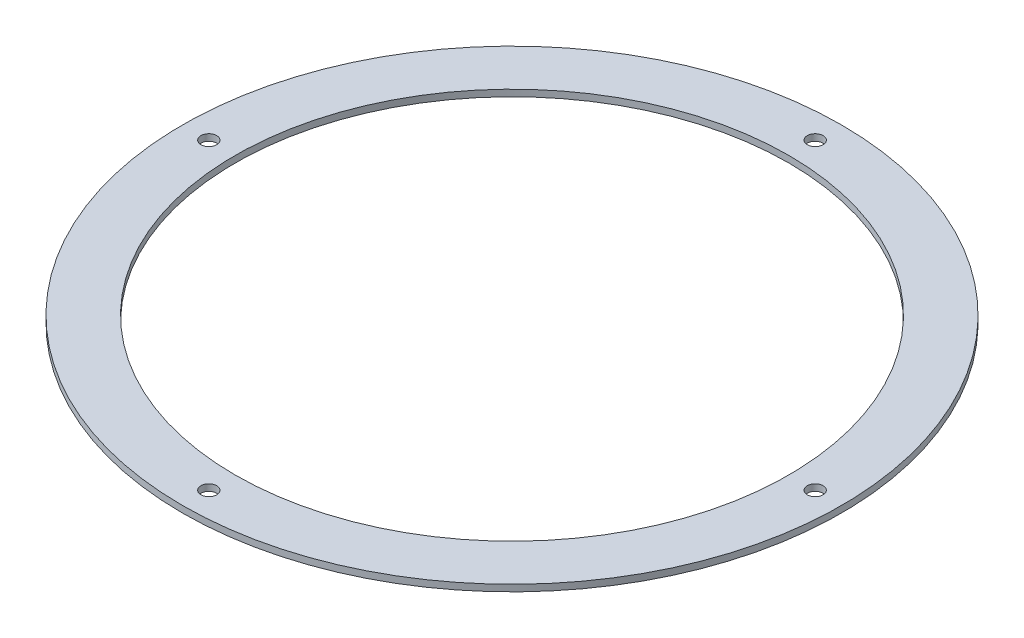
ISO-10303-21;
HEADER;
FILE_DESCRIPTION(('STEP AP214'),'2;1');
FILE_NAME('part.step','',(''),(''),'','','');
FILE_SCHEMA(('AUTOMOTIVE_DESIGN { 1 0 10303 214 1 1 1 1 }'));
ENDSEC;
DATA;
#1=APPLICATION_CONTEXT('core data for automotive mechanical design processes');
#2=APPLICATION_PROTOCOL_DEFINITION('international standard','automotive_design',2000,#1);
#3=PRODUCT_CONTEXT('',#1,'mechanical');
#4=PRODUCT('Part','Part','',(#3));
#5=PRODUCT_RELATED_PRODUCT_CATEGORY('part','',(#4));
#6=PRODUCT_DEFINITION_FORMATION('','',#4);
#7=PRODUCT_DEFINITION_CONTEXT('part definition',#1,'design');
#8=PRODUCT_DEFINITION('design','',#6,#7);
#9=PRODUCT_DEFINITION_SHAPE('','',#8);
#10=(LENGTH_UNIT() NAMED_UNIT(*) SI_UNIT(.MILLI.,.METRE.));
#11=(NAMED_UNIT(*) PLANE_ANGLE_UNIT() SI_UNIT($,.RADIAN.));
#12=(NAMED_UNIT(*) SI_UNIT($,.STERADIAN.) SOLID_ANGLE_UNIT());
#13=UNCERTAINTY_MEASURE_WITH_UNIT(LENGTH_MEASURE(1.E-05),#10,'distance_accuracy_value','');
#14=(GEOMETRIC_REPRESENTATION_CONTEXT(3) GLOBAL_UNCERTAINTY_ASSIGNED_CONTEXT((#13)) GLOBAL_UNIT_ASSIGNED_CONTEXT((#10,
#11,#12)) REPRESENTATION_CONTEXT('',''));
#15=CARTESIAN_POINT('',(0.,0.,0.));
#16=DIRECTION('',(0.,0.,1.));
#17=DIRECTION('',(1.,0.,0.));
#18=AXIS2_PLACEMENT_3D('',#15,#16,#17);
#19=CARTESIAN_POINT('',(0.,0.5,0.));
#20=DIRECTION('',(0.,1.,0.));
#21=DIRECTION('',(0.,0.,1.));
#22=AXIS2_PLACEMENT_3D('',#19,#20,#21);
#23=PLANE('',#22);
#24=CARTESIAN_POINT('',(-2.38095524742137E-13,0.5,23.));
#25=DIRECTION('',(0.,1.,0.));
#26=DIRECTION('',(1.,0.,0.));
#27=AXIS2_PLACEMENT_3D('',#24,#25,#26);
#28=CIRCLE('',#27,0.6);
#29=CARTESIAN_POINT('',(0.599999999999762,0.5,23.));
#30=VERTEX_POINT('',#29);
#31=EDGE_CURVE('E76',#30,#30,#28,.T.);
#32=ORIENTED_EDGE('',*,*,#31,.F.);
#33=EDGE_LOOP('',(#32));
#34=FACE_BOUND('',#33,.T.);
#35=CARTESIAN_POINT('',(23.,0.5,0.));
#36=DIRECTION('',(0.,1.,0.));
#37=DIRECTION('',(0.,0.,-1.));
#38=AXIS2_PLACEMENT_3D('',#35,#36,#37);
#39=CIRCLE('',#38,0.6);
#40=CARTESIAN_POINT('',(23.,0.5,-0.600000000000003));
#41=VERTEX_POINT('',#40);
#42=EDGE_CURVE('E70',#41,#41,#39,.T.);
#43=ORIENTED_EDGE('',*,*,#42,.F.);
#44=EDGE_LOOP('',(#43));
#45=FACE_BOUND('',#44,.T.);
#46=CARTESIAN_POINT('',(0.,0.5,-23.));
#47=DIRECTION('',(0.,1.,0.));
#48=DIRECTION('',(-1.,0.,0.));
#49=AXIS2_PLACEMENT_3D('',#46,#47,#48);
#50=CIRCLE('',#49,0.6);
#51=CARTESIAN_POINT('',(-0.599999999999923,0.5,-23.));
#52=VERTEX_POINT('',#51);
#53=EDGE_CURVE('E64',#52,#52,#50,.T.);
#54=ORIENTED_EDGE('',*,*,#53,.F.);
#55=EDGE_LOOP('',(#54));
#56=FACE_BOUND('',#55,.T.);
#57=CARTESIAN_POINT('',(-23.,0.5,0.));
#58=DIRECTION('',(0.,1.,0.));
#59=DIRECTION('',(0.,0.,1.));
#60=AXIS2_PLACEMENT_3D('',#57,#58,#59);
#61=CIRCLE('',#60,0.6);
#62=CARTESIAN_POINT('',(-23.,0.5,0.600000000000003));
#63=VERTEX_POINT('',#62);
#64=EDGE_CURVE('E58',#63,#63,#61,.T.);
#65=ORIENTED_EDGE('',*,*,#64,.F.);
#66=EDGE_LOOP('',(#65));
#67=FACE_BOUND('',#66,.T.);
#68=CARTESIAN_POINT('',(0.,0.5,0.));
#69=DIRECTION('',(0.,1.,0.));
#70=DIRECTION('',(0.,0.,1.));
#71=AXIS2_PLACEMENT_3D('',#68,#69,#70);
#72=CIRCLE('',#71,25.);
#73=CARTESIAN_POINT('',(0.,0.5,25.));
#74=VERTEX_POINT('',#73);
#75=EDGE_CURVE('E10',#74,#74,#72,.T.);
#76=ORIENTED_EDGE('',*,*,#75,.T.);
#77=EDGE_LOOP('',(#76));
#78=FACE_BOUND('',#77,.T.);
#79=CARTESIAN_POINT('',(0.,0.5,0.));
#80=DIRECTION('',(0.,1.,0.));
#81=DIRECTION('',(0.,0.,1.));
#82=AXIS2_PLACEMENT_3D('',#79,#80,#81);
#83=CIRCLE('',#82,21.);
#84=CARTESIAN_POINT('',(0.,0.5,21.));
#85=VERTEX_POINT('',#84);
#86=EDGE_CURVE('E50',#85,#85,#83,.T.);
#87=ORIENTED_EDGE('',*,*,#86,.F.);
#88=EDGE_LOOP('',(#87));
#89=FACE_BOUND('',#88,.T.);
#90=ADVANCED_FACE('F39',(#34,#45,#56,#67,#78,#89),#23,.T.);
#91=CARTESIAN_POINT('',(0.,0.,0.));
#92=DIRECTION('',(0.,1.,0.));
#93=DIRECTION('',(0.,0.,1.));
#94=AXIS2_PLACEMENT_3D('',#91,#92,#93);
#95=PLANE('',#94);
#96=CARTESIAN_POINT('',(-2.38095524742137E-13,0.,23.));
#97=DIRECTION('',(0.,1.,0.));
#98=DIRECTION('',(1.,0.,0.));
#99=AXIS2_PLACEMENT_3D('',#96,#97,#98);
#100=CIRCLE('',#99,0.6);
#101=CARTESIAN_POINT('',(0.599999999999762,0.,23.));
#102=VERTEX_POINT('',#101);
#103=EDGE_CURVE('E73',#102,#102,#100,.T.);
#104=ORIENTED_EDGE('',*,*,#103,.T.);
#105=EDGE_LOOP('',(#104));
#106=FACE_BOUND('',#105,.T.);
#107=CARTESIAN_POINT('',(23.,0.,0.));
#108=DIRECTION('',(0.,1.,0.));
#109=DIRECTION('',(0.,0.,-1.));
#110=AXIS2_PLACEMENT_3D('',#107,#108,#109);
#111=CIRCLE('',#110,0.6);
#112=CARTESIAN_POINT('',(23.,0.,-0.600000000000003));
#113=VERTEX_POINT('',#112);
#114=EDGE_CURVE('E67',#113,#113,#111,.T.);
#115=ORIENTED_EDGE('',*,*,#114,.T.);
#116=EDGE_LOOP('',(#115));
#117=FACE_BOUND('',#116,.T.);
#118=CARTESIAN_POINT('',(0.,0.,-23.));
#119=DIRECTION('',(0.,1.,0.));
#120=DIRECTION('',(-1.,0.,0.));
#121=AXIS2_PLACEMENT_3D('',#118,#119,#120);
#122=CIRCLE('',#121,0.6);
#123=CARTESIAN_POINT('',(-0.599999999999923,0.,-23.));
#124=VERTEX_POINT('',#123);
#125=EDGE_CURVE('E61',#124,#124,#122,.T.);
#126=ORIENTED_EDGE('',*,*,#125,.T.);
#127=EDGE_LOOP('',(#126));
#128=FACE_BOUND('',#127,.T.);
#129=CARTESIAN_POINT('',(-23.,0.,0.));
#130=DIRECTION('',(0.,1.,0.));
#131=DIRECTION('',(0.,0.,1.));
#132=AXIS2_PLACEMENT_3D('',#129,#130,#131);
#133=CIRCLE('',#132,0.6);
#134=CARTESIAN_POINT('',(-23.,0.,0.600000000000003));
#135=VERTEX_POINT('',#134);
#136=EDGE_CURVE('E55',#135,#135,#133,.T.);
#137=ORIENTED_EDGE('',*,*,#136,.T.);
#138=EDGE_LOOP('',(#137));
#139=FACE_BOUND('',#138,.T.);
#140=CARTESIAN_POINT('',(0.,0.,0.));
#141=DIRECTION('',(0.,1.,0.));
#142=DIRECTION('',(0.,0.,1.));
#143=AXIS2_PLACEMENT_3D('',#140,#141,#142);
#144=CIRCLE('',#143,25.);
#145=CARTESIAN_POINT('',(0.,0.,25.));
#146=VERTEX_POINT('',#145);
#147=EDGE_CURVE('E43',#146,#146,#144,.T.);
#148=ORIENTED_EDGE('',*,*,#147,.F.);
#149=EDGE_LOOP('',(#148));
#150=FACE_BOUND('',#149,.T.);
#151=CARTESIAN_POINT('',(0.,0.,0.));
#152=DIRECTION('',(0.,1.,0.));
#153=DIRECTION('',(0.,0.,1.));
#154=AXIS2_PLACEMENT_3D('',#151,#152,#153);
#155=CIRCLE('',#154,21.);
#156=CARTESIAN_POINT('',(0.,0.,21.));
#157=VERTEX_POINT('',#156);
#158=EDGE_CURVE('E52',#157,#157,#155,.T.);
#159=ORIENTED_EDGE('',*,*,#158,.T.);
#160=EDGE_LOOP('',(#159));
#161=FACE_BOUND('',#160,.T.);
#162=ADVANCED_FACE('F82',(#106,#117,#128,#139,#150,#161),#95,.F.);
#163=CARTESIAN_POINT('',(0.,0.5,0.));
#164=DIRECTION('',(0.,-1.,0.));
#165=DIRECTION('',(0.,0.,-1.));
#166=AXIS2_PLACEMENT_3D('',#163,#164,#165);
#167=CYLINDRICAL_SURFACE('',#166,25.);
#168=ORIENTED_EDGE('',*,*,#75,.F.);
#169=EDGE_LOOP('',(#168));
#170=FACE_BOUND('',#169,.T.);
#171=ORIENTED_EDGE('',*,*,#147,.T.);
#172=EDGE_LOOP('',(#171));
#173=FACE_BOUND('',#172,.T.);
#174=ADVANCED_FACE('F41',(#170,#173),#167,.T.);
#175=CARTESIAN_POINT('',(0.,0.5,0.));
#176=DIRECTION('',(0.,-1.,0.));
#177=DIRECTION('',(0.,0.,-1.));
#178=AXIS2_PLACEMENT_3D('',#175,#176,#177);
#179=CYLINDRICAL_SURFACE('',#178,21.);
#180=ORIENTED_EDGE('',*,*,#86,.T.);
#181=EDGE_LOOP('',(#180));
#182=FACE_BOUND('',#181,.T.);
#183=ORIENTED_EDGE('',*,*,#158,.F.);
#184=EDGE_LOOP('',(#183));
#185=FACE_BOUND('',#184,.T.);
#186=ADVANCED_FACE('F103',(#182,#185),#179,.F.);
#187=CARTESIAN_POINT('',(-23.,0.,0.));
#188=DIRECTION('',(0.,1.,0.));
#189=DIRECTION('',(0.,0.,1.));
#190=AXIS2_PLACEMENT_3D('',#187,#188,#189);
#191=CYLINDRICAL_SURFACE('',#190,0.6);
#192=ORIENTED_EDGE('',*,*,#136,.F.);
#193=EDGE_LOOP('',(#192));
#194=FACE_BOUND('',#193,.T.);
#195=ORIENTED_EDGE('',*,*,#64,.T.);
#196=EDGE_LOOP('',(#195));
#197=FACE_BOUND('',#196,.T.);
#198=ADVANCED_FACE('F106',(#194,#197),#191,.F.);
#199=CARTESIAN_POINT('',(0.,0.,-23.));
#200=DIRECTION('',(0.,1.,0.));
#201=DIRECTION('',(0.,0.,1.));
#202=AXIS2_PLACEMENT_3D('',#199,#200,#201);
#203=CYLINDRICAL_SURFACE('',#202,0.6);
#204=ORIENTED_EDGE('',*,*,#125,.F.);
#205=EDGE_LOOP('',(#204));
#206=FACE_BOUND('',#205,.T.);
#207=ORIENTED_EDGE('',*,*,#53,.T.);
#208=EDGE_LOOP('',(#207));
#209=FACE_BOUND('',#208,.T.);
#210=ADVANCED_FACE('F118',(#206,#209),#203,.F.);
#211=CARTESIAN_POINT('',(23.,0.,0.));
#212=DIRECTION('',(0.,1.,0.));
#213=DIRECTION('',(0.,0.,1.));
#214=AXIS2_PLACEMENT_3D('',#211,#212,#213);
#215=CYLINDRICAL_SURFACE('',#214,0.6);
#216=ORIENTED_EDGE('',*,*,#114,.F.);
#217=EDGE_LOOP('',(#216));
#218=FACE_BOUND('',#217,.T.);
#219=ORIENTED_EDGE('',*,*,#42,.T.);
#220=EDGE_LOOP('',(#219));
#221=FACE_BOUND('',#220,.T.);
#222=ADVANCED_FACE('F88',(#218,#221),#215,.F.);
#223=CARTESIAN_POINT('',(-2.38095524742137E-13,0.,23.));
#224=DIRECTION('',(0.,1.,0.));
#225=DIRECTION('',(0.,0.,1.));
#226=AXIS2_PLACEMENT_3D('',#223,#224,#225);
#227=CYLINDRICAL_SURFACE('',#226,0.6);
#228=ORIENTED_EDGE('',*,*,#103,.F.);
#229=EDGE_LOOP('',(#228));
#230=FACE_BOUND('',#229,.T.);
#231=ORIENTED_EDGE('',*,*,#31,.T.);
#232=EDGE_LOOP('',(#231));
#233=FACE_BOUND('',#232,.T.);
#234=ADVANCED_FACE('F85',(#230,#233),#227,.F.);
#235=CLOSED_SHELL('',(#90,#162,#174,#186,#198,#210,#222,#234));
#236=MANIFOLD_SOLID_BREP('B2',#235);
#237=ADVANCED_BREP_SHAPE_REPRESENTATION('',(#18,#236),#14);
#238=SHAPE_DEFINITION_REPRESENTATION(#9,#237);
ENDSEC;
END-ISO-10303-21;
